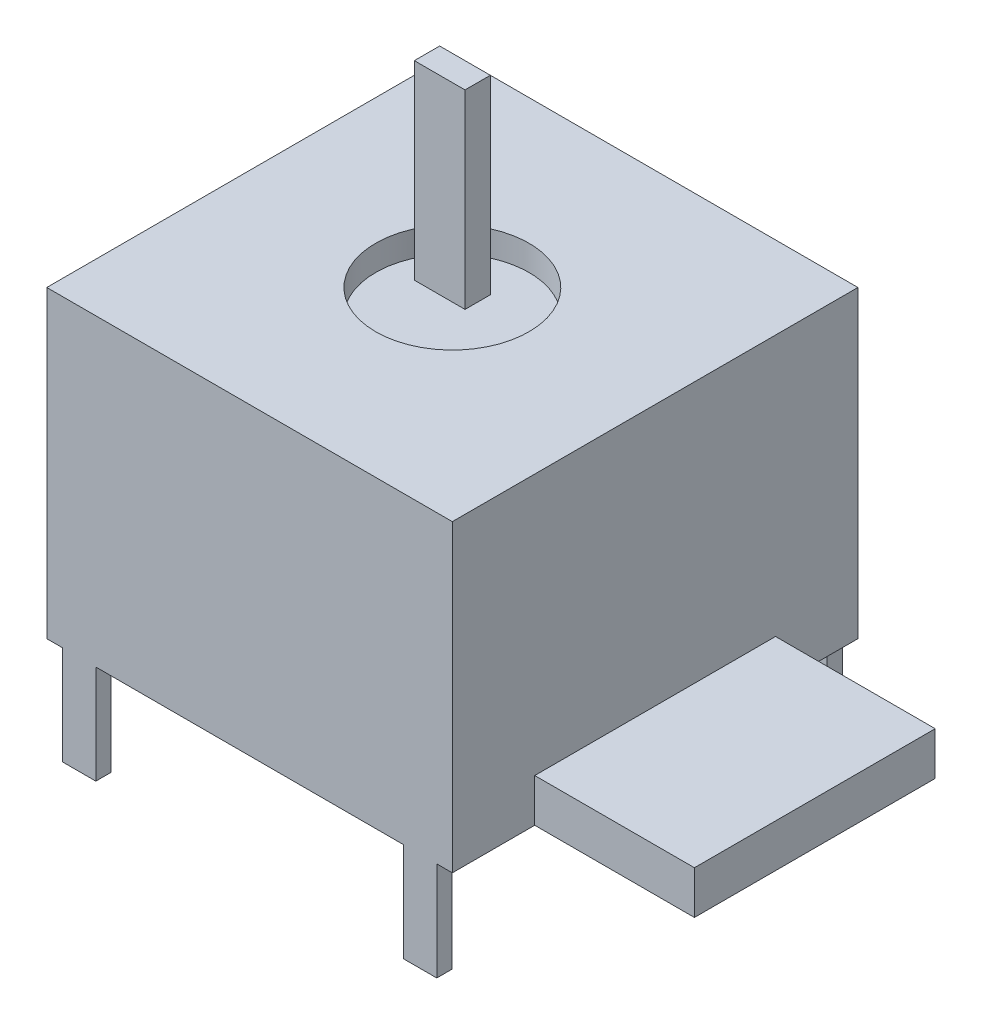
ISO-10303-21;
HEADER;
FILE_DESCRIPTION(('STEP AP214'),'2;1');
FILE_NAME('part.step','',(''),(''),'','','');
FILE_SCHEMA(('AUTOMOTIVE_DESIGN { 1 0 10303 214 1 1 1 1 }'));
ENDSEC;
DATA;
#1=APPLICATION_CONTEXT('core data for automotive mechanical design processes');
#2=APPLICATION_PROTOCOL_DEFINITION('international standard','automotive_design',2000,#1);
#3=PRODUCT_CONTEXT('',#1,'mechanical');
#4=PRODUCT('Part','Part','',(#3));
#5=PRODUCT_RELATED_PRODUCT_CATEGORY('part','',(#4));
#6=PRODUCT_DEFINITION_FORMATION('','',#4);
#7=PRODUCT_DEFINITION_CONTEXT('part definition',#1,'design');
#8=PRODUCT_DEFINITION('design','',#6,#7);
#9=PRODUCT_DEFINITION_SHAPE('','',#8);
#10=(LENGTH_UNIT() NAMED_UNIT(*) SI_UNIT(.MILLI.,.METRE.));
#11=(NAMED_UNIT(*) PLANE_ANGLE_UNIT() SI_UNIT($,.RADIAN.));
#12=(NAMED_UNIT(*) SI_UNIT($,.STERADIAN.) SOLID_ANGLE_UNIT());
#13=UNCERTAINTY_MEASURE_WITH_UNIT(LENGTH_MEASURE(1.E-05),#10,'distance_accuracy_value','');
#14=(GEOMETRIC_REPRESENTATION_CONTEXT(3) GLOBAL_UNCERTAINTY_ASSIGNED_CONTEXT((#13)) GLOBAL_UNIT_ASSIGNED_CONTEXT((#10,
#11,#12)) REPRESENTATION_CONTEXT('',''));
#15=CARTESIAN_POINT('',(0.,0.,0.));
#16=DIRECTION('',(0.,0.,1.));
#17=DIRECTION('',(1.,0.,0.));
#18=AXIS2_PLACEMENT_3D('',#15,#16,#17);
#19=CARTESIAN_POINT('',(0.,12.,-16.));
#20=DIRECTION('',(0.,-1.,0.));
#21=DIRECTION('',(0.,0.,-1.));
#22=AXIS2_PLACEMENT_3D('',#19,#20,#21);
#23=PLANE('',#22);
#24=CARTESIAN_POINT('',(8.,12.,-8.));
#25=DIRECTION('',(0.,1.,0.));
#26=DIRECTION('',(0.,0.,1.));
#27=AXIS2_PLACEMENT_3D('',#24,#25,#26);
#28=CIRCLE('',#27,3.02568881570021);
#29=CARTESIAN_POINT('',(8.,12.,-4.97431118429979));
#30=VERTEX_POINT('',#29);
#31=EDGE_CURVE('E40',#30,#30,#28,.T.);
#32=ORIENTED_EDGE('',*,*,#31,.F.);
#33=EDGE_LOOP('',(#32));
#34=FACE_BOUND('',#33,.T.);
#35=DIRECTION('',(0.,0.,1.));
#36=VECTOR('',#35,1.);
#37=CARTESIAN_POINT('',(0.,12.,0.));
#38=LINE('',#37,#36);
#39=CARTESIAN_POINT('',(0.,12.,-16.));
#40=VERTEX_POINT('',#39);
#41=CARTESIAN_POINT('',(0.,12.,0.));
#42=VERTEX_POINT('',#41);
#43=EDGE_CURVE('E282',#40,#42,#38,.T.);
#44=ORIENTED_EDGE('',*,*,#43,.T.);
#45=DIRECTION('',(1.,0.,0.));
#46=VECTOR('',#45,1.);
#47=CARTESIAN_POINT('',(0.,12.,0.));
#48=LINE('',#47,#46);
#49=CARTESIAN_POINT('',(16.,12.,0.));
#50=VERTEX_POINT('',#49);
#51=EDGE_CURVE('E280',#42,#50,#48,.T.);
#52=ORIENTED_EDGE('',*,*,#51,.T.);
#53=DIRECTION('',(0.,0.,-1.));
#54=VECTOR('',#53,1.);
#55=CARTESIAN_POINT('',(16.,12.,0.));
#56=LINE('',#55,#54);
#57=CARTESIAN_POINT('',(16.,12.,-16.));
#58=VERTEX_POINT('',#57);
#59=EDGE_CURVE('E277',#50,#58,#56,.T.);
#60=ORIENTED_EDGE('',*,*,#59,.T.);
#61=DIRECTION('',(-1.,0.,0.));
#62=VECTOR('',#61,1.);
#63=CARTESIAN_POINT('',(0.,12.,-16.));
#64=LINE('',#63,#62);
#65=EDGE_CURVE('E273',#58,#40,#64,.T.);
#66=ORIENTED_EDGE('',*,*,#65,.T.);
#67=EDGE_LOOP('',(#44,#52,#60,#66));
#68=FACE_BOUND('',#67,.T.);
#69=ADVANCED_FACE('F36',(#34,#68),#23,.F.);
#70=CARTESIAN_POINT('',(0.,0.,-16.));
#71=DIRECTION('',(0.,-1.,0.));
#72=DIRECTION('',(0.,0.,-1.));
#73=AXIS2_PLACEMENT_3D('',#70,#71,#72);
#74=PLANE('',#73);
#75=DIRECTION('',(-1.,0.,0.));
#76=VECTOR('',#75,1.);
#77=CARTESIAN_POINT('',(0.615000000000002,0.,-15.4));
#78=LINE('',#77,#76);
#79=CARTESIAN_POINT('',(1.935,0.,-15.4));
#80=VERTEX_POINT('',#79);
#81=CARTESIAN_POINT('',(0.615000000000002,0.,-15.4));
#82=VERTEX_POINT('',#81);
#83=EDGE_CURVE('E200',#80,#82,#78,.T.);
#84=ORIENTED_EDGE('',*,*,#83,.F.);
#85=DIRECTION('',(0.,0.,1.));
#86=VECTOR('',#85,1.);
#87=CARTESIAN_POINT('',(1.935,0.,-16.));
#88=LINE('',#87,#86);
#89=CARTESIAN_POINT('',(1.935,0.,-16.));
#90=VERTEX_POINT('',#89);
#91=EDGE_CURVE('E75',#90,#80,#88,.T.);
#92=ORIENTED_EDGE('',*,*,#91,.F.);
#93=DIRECTION('',(-1.,0.,0.));
#94=VECTOR('',#93,1.);
#95=CARTESIAN_POINT('',(0.,0.,-16.));
#96=LINE('',#95,#94);
#97=CARTESIAN_POINT('',(14.065,0.,-16.));
#98=VERTEX_POINT('',#97);
#99=EDGE_CURVE('E186',#98,#90,#96,.T.);
#100=ORIENTED_EDGE('',*,*,#99,.F.);
#101=DIRECTION('',(0.,0.,-1.));
#102=VECTOR('',#101,1.);
#103=CARTESIAN_POINT('',(14.065,0.,-16.));
#104=LINE('',#103,#102);
#105=CARTESIAN_POINT('',(14.065,0.,-15.4));
#106=VERTEX_POINT('',#105);
#107=EDGE_CURVE('E178',#106,#98,#104,.T.);
#108=ORIENTED_EDGE('',*,*,#107,.F.);
#109=DIRECTION('',(-1.,0.,0.));
#110=VECTOR('',#109,1.);
#111=CARTESIAN_POINT('',(14.065,0.,-15.4));
#112=LINE('',#111,#110);
#113=CARTESIAN_POINT('',(15.385,0.,-15.4));
#114=VERTEX_POINT('',#113);
#115=EDGE_CURVE('E175',#114,#106,#112,.T.);
#116=ORIENTED_EDGE('',*,*,#115,.F.);
#117=DIRECTION('',(0.,0.,1.));
#118=VECTOR('',#117,1.);
#119=CARTESIAN_POINT('',(15.385,0.,-16.));
#120=LINE('',#119,#118);
#121=CARTESIAN_POINT('',(15.385,0.,-16.));
#122=VERTEX_POINT('',#121);
#123=EDGE_CURVE('E106',#122,#114,#120,.T.);
#124=ORIENTED_EDGE('',*,*,#123,.F.);
#125=CARTESIAN_POINT('',(16.,0.,-16.));
#126=VERTEX_POINT('',#125);
#127=EDGE_CURVE('E187',#126,#122,#96,.T.);
#128=ORIENTED_EDGE('',*,*,#127,.F.);
#129=DIRECTION('',(0.,0.,-1.));
#130=VECTOR('',#129,1.);
#131=CARTESIAN_POINT('',(16.,0.,0.));
#132=LINE('',#131,#130);
#133=CARTESIAN_POINT('',(16.,0.,-12.75));
#134=VERTEX_POINT('',#133);
#135=EDGE_CURVE('E268',#134,#126,#132,.T.);
#136=ORIENTED_EDGE('',*,*,#135,.F.);
#137=DIRECTION('',(-1.,0.,0.));
#138=VECTOR('',#137,1.);
#139=CARTESIAN_POINT('',(22.3,0.,-12.75));
#140=LINE('',#139,#138);
#141=CARTESIAN_POINT('',(22.3,0.,-12.75));
#142=VERTEX_POINT('',#141);
#143=EDGE_CURVE('E326',#142,#134,#140,.T.);
#144=ORIENTED_EDGE('',*,*,#143,.F.);
#145=DIRECTION('',(0.,0.,-1.));
#146=VECTOR('',#145,1.);
#147=CARTESIAN_POINT('',(22.3,0.,-3.25000000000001));
#148=LINE('',#147,#146);
#149=CARTESIAN_POINT('',(22.3,0.,-3.25000000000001));
#150=VERTEX_POINT('',#149);
#151=EDGE_CURVE('E319',#150,#142,#148,.T.);
#152=ORIENTED_EDGE('',*,*,#151,.F.);
#153=DIRECTION('',(-1.,0.,0.));
#154=VECTOR('',#153,1.);
#155=CARTESIAN_POINT('',(22.3,0.,-3.25000000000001));
#156=LINE('',#155,#154);
#157=CARTESIAN_POINT('',(16.,0.,-3.25));
#158=VERTEX_POINT('',#157);
#159=EDGE_CURVE('E276',#150,#158,#156,.T.);
#160=ORIENTED_EDGE('',*,*,#159,.T.);
#161=CARTESIAN_POINT('',(16.,0.,0.));
#162=VERTEX_POINT('',#161);
#163=EDGE_CURVE('E264',#162,#158,#132,.T.);
#164=ORIENTED_EDGE('',*,*,#163,.F.);
#165=DIRECTION('',(1.,0.,0.));
#166=VECTOR('',#165,1.);
#167=CARTESIAN_POINT('',(0.,0.,0.));
#168=LINE('',#167,#166);
#169=CARTESIAN_POINT('',(15.385,0.,0.));
#170=VERTEX_POINT('',#169);
#171=EDGE_CURVE('E164',#170,#162,#168,.T.);
#172=ORIENTED_EDGE('',*,*,#171,.F.);
#173=DIRECTION('',(0.,0.,1.));
#174=VECTOR('',#173,1.);
#175=CARTESIAN_POINT('',(15.385,0.,0.));
#176=LINE('',#175,#174);
#177=CARTESIAN_POINT('',(15.385,0.,-0.6));
#178=VERTEX_POINT('',#177);
#179=EDGE_CURVE('E155',#178,#170,#176,.T.);
#180=ORIENTED_EDGE('',*,*,#179,.F.);
#181=DIRECTION('',(1.,0.,0.));
#182=VECTOR('',#181,1.);
#183=CARTESIAN_POINT('',(14.065,0.,-0.6));
#184=LINE('',#183,#182);
#185=CARTESIAN_POINT('',(14.065,0.,-0.6));
#186=VERTEX_POINT('',#185);
#187=EDGE_CURVE('E137',#186,#178,#184,.T.);
#188=ORIENTED_EDGE('',*,*,#187,.F.);
#189=DIRECTION('',(0.,0.,-1.));
#190=VECTOR('',#189,1.);
#191=CARTESIAN_POINT('',(14.065,0.,0.));
#192=LINE('',#191,#190);
#193=CARTESIAN_POINT('',(14.065,0.,0.));
#194=VERTEX_POINT('',#193);
#195=EDGE_CURVE('E170',#194,#186,#192,.T.);
#196=ORIENTED_EDGE('',*,*,#195,.F.);
#197=CARTESIAN_POINT('',(1.935,0.,0.));
#198=VERTEX_POINT('',#197);
#199=EDGE_CURVE('E610',#198,#194,#168,.T.);
#200=ORIENTED_EDGE('',*,*,#199,.F.);
#201=DIRECTION('',(0.,0.,1.));
#202=VECTOR('',#201,1.);
#203=CARTESIAN_POINT('',(1.935,0.,0.));
#204=LINE('',#203,#202);
#205=CARTESIAN_POINT('',(1.935,0.,-0.6));
#206=VERTEX_POINT('',#205);
#207=EDGE_CURVE('E621',#206,#198,#204,.T.);
#208=ORIENTED_EDGE('',*,*,#207,.F.);
#209=DIRECTION('',(1.,0.,0.));
#210=VECTOR('',#209,1.);
#211=CARTESIAN_POINT('',(0.615000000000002,0.,-0.6));
#212=LINE('',#211,#210);
#213=CARTESIAN_POINT('',(0.615000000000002,0.,-0.6));
#214=VERTEX_POINT('',#213);
#215=EDGE_CURVE('E600',#214,#206,#212,.T.);
#216=ORIENTED_EDGE('',*,*,#215,.F.);
#217=DIRECTION('',(0.,0.,-1.));
#218=VECTOR('',#217,1.);
#219=CARTESIAN_POINT('',(0.615000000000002,0.,0.));
#220=LINE('',#219,#218);
#221=CARTESIAN_POINT('',(0.615000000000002,0.,0.));
#222=VERTEX_POINT('',#221);
#223=EDGE_CURVE('E315',#222,#214,#220,.T.);
#224=ORIENTED_EDGE('',*,*,#223,.F.);
#225=CARTESIAN_POINT('',(0.,0.,0.));
#226=VERTEX_POINT('',#225);
#227=EDGE_CURVE('E272',#226,#222,#168,.T.);
#228=ORIENTED_EDGE('',*,*,#227,.F.);
#229=DIRECTION('',(0.,0.,1.));
#230=VECTOR('',#229,1.);
#231=CARTESIAN_POINT('',(0.,0.,0.));
#232=LINE('',#231,#230);
#233=CARTESIAN_POINT('',(0.,0.,-16.));
#234=VERTEX_POINT('',#233);
#235=EDGE_CURVE('E235',#234,#226,#232,.T.);
#236=ORIENTED_EDGE('',*,*,#235,.F.);
#237=CARTESIAN_POINT('',(0.615000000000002,0.,-16.));
#238=VERTEX_POINT('',#237);
#239=EDGE_CURVE('E211',#238,#234,#96,.T.);
#240=ORIENTED_EDGE('',*,*,#239,.F.);
#241=DIRECTION('',(0.,0.,-1.));
#242=VECTOR('',#241,1.);
#243=CARTESIAN_POINT('',(0.615000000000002,0.,-16.));
#244=LINE('',#243,#242);
#245=EDGE_CURVE('E203',#82,#238,#244,.T.);
#246=ORIENTED_EDGE('',*,*,#245,.F.);
#247=EDGE_LOOP('',(#84,#92,#100,#108,#116,#124,#128,#136,#144,#152,#160,#164,#172,#180,#188,
#196,#200,#208,#216,#224,#228,#236,#240,#246));
#248=FACE_BOUND('',#247,.T.);
#249=ADVANCED_FACE('F161',(#248),#74,.T.);
#250=CARTESIAN_POINT('',(16.,12.,0.));
#251=DIRECTION('',(-1.,0.,0.));
#252=DIRECTION('',(0.,0.,1.));
#253=AXIS2_PLACEMENT_3D('',#250,#251,#252);
#254=PLANE('',#253);
#255=DIRECTION('',(0.,-1.,0.));
#256=VECTOR('',#255,1.);
#257=CARTESIAN_POINT('',(16.,0.,-3.25));
#258=LINE('',#257,#256);
#259=CARTESIAN_POINT('',(16.,1.7,-3.25));
#260=VERTEX_POINT('',#259);
#261=EDGE_CURVE('E244',#260,#158,#258,.T.);
#262=ORIENTED_EDGE('',*,*,#261,.F.);
#263=DIRECTION('',(0.,0.,1.));
#264=VECTOR('',#263,1.);
#265=CARTESIAN_POINT('',(16.,1.7,-3.25));
#266=LINE('',#265,#264);
#267=CARTESIAN_POINT('',(16.,1.7,-12.75));
#268=VERTEX_POINT('',#267);
#269=EDGE_CURVE('E307',#268,#260,#266,.T.);
#270=ORIENTED_EDGE('',*,*,#269,.F.);
#271=DIRECTION('',(0.,1.,0.));
#272=VECTOR('',#271,1.);
#273=CARTESIAN_POINT('',(16.,0.,-12.75));
#274=LINE('',#273,#272);
#275=EDGE_CURVE('E311',#134,#268,#274,.T.);
#276=ORIENTED_EDGE('',*,*,#275,.F.);
#277=ORIENTED_EDGE('',*,*,#135,.T.);
#278=DIRECTION('',(0.,-1.,0.));
#279=VECTOR('',#278,1.);
#280=CARTESIAN_POINT('',(16.,12.,-16.));
#281=LINE('',#280,#279);
#282=EDGE_CURVE('E241',#58,#126,#281,.T.);
#283=ORIENTED_EDGE('',*,*,#282,.F.);
#284=ORIENTED_EDGE('',*,*,#59,.F.);
#285=DIRECTION('',(0.,-1.,0.));
#286=VECTOR('',#285,1.);
#287=CARTESIAN_POINT('',(16.,12.,0.));
#288=LINE('',#287,#286);
#289=EDGE_CURVE('E266',#50,#162,#288,.T.);
#290=ORIENTED_EDGE('',*,*,#289,.T.);
#291=ORIENTED_EDGE('',*,*,#163,.T.);
#292=EDGE_LOOP('',(#262,#270,#276,#277,#283,#284,#290,#291));
#293=FACE_BOUND('',#292,.T.);
#294=ADVANCED_FACE('F356',(#293),#254,.F.);
#295=CARTESIAN_POINT('',(0.,12.,0.));
#296=DIRECTION('',(1.,0.,0.));
#297=DIRECTION('',(0.,0.,-1.));
#298=AXIS2_PLACEMENT_3D('',#295,#296,#297);
#299=PLANE('',#298);
#300=ORIENTED_EDGE('',*,*,#235,.T.);
#301=DIRECTION('',(0.,-1.,0.));
#302=VECTOR('',#301,1.);
#303=CARTESIAN_POINT('',(0.,12.,0.));
#304=LINE('',#303,#302);
#305=EDGE_CURVE('E250',#42,#226,#304,.T.);
#306=ORIENTED_EDGE('',*,*,#305,.F.);
#307=ORIENTED_EDGE('',*,*,#43,.F.);
#308=DIRECTION('',(0.,-1.,0.));
#309=VECTOR('',#308,1.);
#310=CARTESIAN_POINT('',(0.,12.,-16.));
#311=LINE('',#310,#309);
#312=EDGE_CURVE('E270',#40,#234,#311,.T.);
#313=ORIENTED_EDGE('',*,*,#312,.T.);
#314=EDGE_LOOP('',(#300,#306,#307,#313));
#315=FACE_BOUND('',#314,.T.);
#316=ADVANCED_FACE('F294',(#315),#299,.F.);
#317=CARTESIAN_POINT('',(0.,12.,0.));
#318=DIRECTION('',(0.,0.,-1.));
#319=DIRECTION('',(-1.,0.,0.));
#320=AXIS2_PLACEMENT_3D('',#317,#318,#319);
#321=PLANE('',#320);
#322=ORIENTED_EDGE('',*,*,#227,.T.);
#323=DIRECTION('',(0.,1.,0.));
#324=VECTOR('',#323,1.);
#325=CARTESIAN_POINT('',(0.615000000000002,-3.9,0.));
#326=LINE('',#325,#324);
#327=CARTESIAN_POINT('',(0.615000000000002,-3.9,0.));
#328=VERTEX_POINT('',#327);
#329=EDGE_CURVE('E590',#328,#222,#326,.T.);
#330=ORIENTED_EDGE('',*,*,#329,.F.);
#331=DIRECTION('',(-1.,0.,0.));
#332=VECTOR('',#331,1.);
#333=CARTESIAN_POINT('',(0.615000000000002,-3.9,0.));
#334=LINE('',#333,#332);
#335=CARTESIAN_POINT('',(1.935,-3.9,0.));
#336=VERTEX_POINT('',#335);
#337=EDGE_CURVE('E172',#336,#328,#334,.T.);
#338=ORIENTED_EDGE('',*,*,#337,.F.);
#339=DIRECTION('',(0.,1.,0.));
#340=VECTOR('',#339,1.);
#341=CARTESIAN_POINT('',(1.935,-3.9,0.));
#342=LINE('',#341,#340);
#343=EDGE_CURVE('E595',#336,#198,#342,.T.);
#344=ORIENTED_EDGE('',*,*,#343,.T.);
#345=ORIENTED_EDGE('',*,*,#199,.T.);
#346=DIRECTION('',(0.,1.,0.));
#347=VECTOR('',#346,1.);
#348=CARTESIAN_POINT('',(14.065,-3.9,0.));
#349=LINE('',#348,#347);
#350=CARTESIAN_POINT('',(14.065,-3.9,0.));
#351=VERTEX_POINT('',#350);
#352=EDGE_CURVE('E148',#351,#194,#349,.T.);
#353=ORIENTED_EDGE('',*,*,#352,.F.);
#354=DIRECTION('',(-1.,0.,0.));
#355=VECTOR('',#354,1.);
#356=CARTESIAN_POINT('',(14.065,-3.9,0.));
#357=LINE('',#356,#355);
#358=CARTESIAN_POINT('',(15.385,-3.9,0.));
#359=VERTEX_POINT('',#358);
#360=EDGE_CURVE('E115',#359,#351,#357,.T.);
#361=ORIENTED_EDGE('',*,*,#360,.F.);
#362=DIRECTION('',(0.,1.,0.));
#363=VECTOR('',#362,1.);
#364=CARTESIAN_POINT('',(15.385,-3.9,0.));
#365=LINE('',#364,#363);
#366=EDGE_CURVE('E260',#359,#170,#365,.T.);
#367=ORIENTED_EDGE('',*,*,#366,.T.);
#368=ORIENTED_EDGE('',*,*,#171,.T.);
#369=ORIENTED_EDGE('',*,*,#289,.F.);
#370=ORIENTED_EDGE('',*,*,#51,.F.);
#371=ORIENTED_EDGE('',*,*,#305,.T.);
#372=EDGE_LOOP('',(#322,#330,#338,#344,#345,#353,#361,#367,#368,#369,#370,#371));
#373=FACE_BOUND('',#372,.T.);
#374=ADVANCED_FACE('F552',(#373),#321,.F.);
#375=CARTESIAN_POINT('',(0.,12.,-16.));
#376=DIRECTION('',(0.,0.,1.));
#377=DIRECTION('',(1.,0.,0.));
#378=AXIS2_PLACEMENT_3D('',#375,#376,#377);
#379=PLANE('',#378);
#380=ORIENTED_EDGE('',*,*,#127,.T.);
#381=DIRECTION('',(0.,1.,0.));
#382=VECTOR('',#381,1.);
#383=CARTESIAN_POINT('',(15.385,-3.9,-16.));
#384=LINE('',#383,#382);
#385=CARTESIAN_POINT('',(15.385,-3.9,-16.));
#386=VERTEX_POINT('',#385);
#387=EDGE_CURVE('E173',#386,#122,#384,.T.);
#388=ORIENTED_EDGE('',*,*,#387,.F.);
#389=DIRECTION('',(1.,0.,0.));
#390=VECTOR('',#389,1.);
#391=CARTESIAN_POINT('',(14.065,-3.9,-16.));
#392=LINE('',#391,#390);
#393=CARTESIAN_POINT('',(14.065,-3.9,-16.));
#394=VERTEX_POINT('',#393);
#395=EDGE_CURVE('E182',#394,#386,#392,.T.);
#396=ORIENTED_EDGE('',*,*,#395,.F.);
#397=DIRECTION('',(0.,1.,0.));
#398=VECTOR('',#397,1.);
#399=CARTESIAN_POINT('',(14.065,-3.9,-16.));
#400=LINE('',#399,#398);
#401=EDGE_CURVE('E183',#394,#98,#400,.T.);
#402=ORIENTED_EDGE('',*,*,#401,.T.);
#403=ORIENTED_EDGE('',*,*,#99,.T.);
#404=DIRECTION('',(0.,1.,0.));
#405=VECTOR('',#404,1.);
#406=CARTESIAN_POINT('',(1.935,-3.9,-16.));
#407=LINE('',#406,#405);
#408=CARTESIAN_POINT('',(1.935,-3.9,-16.));
#409=VERTEX_POINT('',#408);
#410=EDGE_CURVE('E198',#409,#90,#407,.T.);
#411=ORIENTED_EDGE('',*,*,#410,.F.);
#412=DIRECTION('',(1.,0.,0.));
#413=VECTOR('',#412,1.);
#414=CARTESIAN_POINT('',(0.615000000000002,-3.9,-16.));
#415=LINE('',#414,#413);
#416=CARTESIAN_POINT('',(0.615000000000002,-3.9,-16.));
#417=VERTEX_POINT('',#416);
#418=EDGE_CURVE('E207',#417,#409,#415,.T.);
#419=ORIENTED_EDGE('',*,*,#418,.F.);
#420=DIRECTION('',(0.,1.,0.));
#421=VECTOR('',#420,1.);
#422=CARTESIAN_POINT('',(0.615000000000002,-3.9,-16.));
#423=LINE('',#422,#421);
#424=EDGE_CURVE('E208',#417,#238,#423,.T.);
#425=ORIENTED_EDGE('',*,*,#424,.T.);
#426=ORIENTED_EDGE('',*,*,#239,.T.);
#427=ORIENTED_EDGE('',*,*,#312,.F.);
#428=ORIENTED_EDGE('',*,*,#65,.F.);
#429=ORIENTED_EDGE('',*,*,#282,.T.);
#430=EDGE_LOOP('',(#380,#388,#396,#402,#403,#411,#419,#425,#426,#427,#428,#429));
#431=FACE_BOUND('',#430,.T.);
#432=ADVANCED_FACE('F364',(#431),#379,.F.);
#433=CARTESIAN_POINT('',(22.3,0.,-3.25000000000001));
#434=DIRECTION('',(0.,0.,-1.));
#435=DIRECTION('',(0.,1.,0.));
#436=AXIS2_PLACEMENT_3D('',#433,#434,#435);
#437=PLANE('',#436);
#438=ORIENTED_EDGE('',*,*,#261,.T.);
#439=ORIENTED_EDGE('',*,*,#159,.F.);
#440=DIRECTION('',(0.,-1.,0.));
#441=VECTOR('',#440,1.);
#442=CARTESIAN_POINT('',(22.3,0.,-3.25000000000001));
#443=LINE('',#442,#441);
#444=CARTESIAN_POINT('',(22.3,1.7,-3.25));
#445=VERTEX_POINT('',#444);
#446=EDGE_CURVE('E306',#445,#150,#443,.T.);
#447=ORIENTED_EDGE('',*,*,#446,.F.);
#448=DIRECTION('',(-1.,0.,0.));
#449=VECTOR('',#448,1.);
#450=CARTESIAN_POINT('',(22.3,1.7,-3.25));
#451=LINE('',#450,#449);
#452=EDGE_CURVE('E308',#445,#260,#451,.T.);
#453=ORIENTED_EDGE('',*,*,#452,.T.);
#454=EDGE_LOOP('',(#438,#439,#447,#453));
#455=FACE_BOUND('',#454,.T.);
#456=ADVANCED_FACE('F402',(#455),#437,.F.);
#457=CARTESIAN_POINT('',(22.3,0.,-12.75));
#458=DIRECTION('',(0.,0.,1.));
#459=DIRECTION('',(0.,-1.,0.));
#460=AXIS2_PLACEMENT_3D('',#457,#458,#459);
#461=PLANE('',#460);
#462=ORIENTED_EDGE('',*,*,#275,.T.);
#463=DIRECTION('',(-1.,0.,0.));
#464=VECTOR('',#463,1.);
#465=CARTESIAN_POINT('',(22.3,1.7,-12.75));
#466=LINE('',#465,#464);
#467=CARTESIAN_POINT('',(22.3,1.7,-12.75));
#468=VERTEX_POINT('',#467);
#469=EDGE_CURVE('E303',#468,#268,#466,.T.);
#470=ORIENTED_EDGE('',*,*,#469,.F.);
#471=DIRECTION('',(0.,1.,0.));
#472=VECTOR('',#471,1.);
#473=CARTESIAN_POINT('',(22.3,0.,-12.75));
#474=LINE('',#473,#472);
#475=EDGE_CURVE('E316',#142,#468,#474,.T.);
#476=ORIENTED_EDGE('',*,*,#475,.F.);
#477=ORIENTED_EDGE('',*,*,#143,.T.);
#478=EDGE_LOOP('',(#462,#470,#476,#477));
#479=FACE_BOUND('',#478,.T.);
#480=ADVANCED_FACE('F405',(#479),#461,.F.);
#481=CARTESIAN_POINT('',(22.3,1.7,-3.25));
#482=DIRECTION('',(0.,-1.,0.));
#483=DIRECTION('',(0.,0.,-1.));
#484=AXIS2_PLACEMENT_3D('',#481,#482,#483);
#485=PLANE('',#484);
#486=ORIENTED_EDGE('',*,*,#269,.T.);
#487=ORIENTED_EDGE('',*,*,#452,.F.);
#488=DIRECTION('',(0.,0.,1.));
#489=VECTOR('',#488,1.);
#490=CARTESIAN_POINT('',(22.3,1.7,-3.25));
#491=LINE('',#490,#489);
#492=EDGE_CURVE('E312',#468,#445,#491,.T.);
#493=ORIENTED_EDGE('',*,*,#492,.F.);
#494=ORIENTED_EDGE('',*,*,#469,.T.);
#495=EDGE_LOOP('',(#486,#487,#493,#494));
#496=FACE_BOUND('',#495,.T.);
#497=ADVANCED_FACE('F409',(#496),#485,.F.);
#498=CARTESIAN_POINT('',(22.3,1.7,-3.25));
#499=DIRECTION('',(-1.,0.,0.));
#500=DIRECTION('',(0.,0.,1.));
#501=AXIS2_PLACEMENT_3D('',#498,#499,#500);
#502=PLANE('',#501);
#503=ORIENTED_EDGE('',*,*,#446,.T.);
#504=ORIENTED_EDGE('',*,*,#151,.T.);
#505=ORIENTED_EDGE('',*,*,#475,.T.);
#506=ORIENTED_EDGE('',*,*,#492,.T.);
#507=EDGE_LOOP('',(#503,#504,#505,#506));
#508=FACE_BOUND('',#507,.T.);
#509=ADVANCED_FACE('F413',(#508),#502,.F.);
#510=CARTESIAN_POINT('',(0.615000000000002,-3.9,0.));
#511=DIRECTION('',(1.,0.,0.));
#512=DIRECTION('',(0.,0.,-1.));
#513=AXIS2_PLACEMENT_3D('',#510,#511,#512);
#514=PLANE('',#513);
#515=ORIENTED_EDGE('',*,*,#223,.T.);
#516=DIRECTION('',(0.,1.,0.));
#517=VECTOR('',#516,1.);
#518=CARTESIAN_POINT('',(0.615000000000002,-3.9,-0.6));
#519=LINE('',#518,#517);
#520=CARTESIAN_POINT('',(0.615000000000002,-3.9,-0.6));
#521=VERTEX_POINT('',#520);
#522=EDGE_CURVE('E329',#521,#214,#519,.T.);
#523=ORIENTED_EDGE('',*,*,#522,.F.);
#524=DIRECTION('',(0.,0.,-1.));
#525=VECTOR('',#524,1.);
#526=CARTESIAN_POINT('',(0.615000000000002,-3.9,0.));
#527=LINE('',#526,#525);
#528=EDGE_CURVE('E599',#328,#521,#527,.T.);
#529=ORIENTED_EDGE('',*,*,#528,.F.);
#530=ORIENTED_EDGE('',*,*,#329,.T.);
#531=EDGE_LOOP('',(#515,#523,#529,#530));
#532=FACE_BOUND('',#531,.T.);
#533=ADVANCED_FACE('F417',(#532),#514,.F.);
#534=CARTESIAN_POINT('',(0.615000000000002,-3.9,-0.6));
#535=DIRECTION('',(0.,0.,1.));
#536=DIRECTION('',(1.,0.,0.));
#537=AXIS2_PLACEMENT_3D('',#534,#535,#536);
#538=PLANE('',#537);
#539=ORIENTED_EDGE('',*,*,#215,.T.);
#540=DIRECTION('',(0.,1.,0.));
#541=VECTOR('',#540,1.);
#542=CARTESIAN_POINT('',(1.935,-3.9,-0.6));
#543=LINE('',#542,#541);
#544=CARTESIAN_POINT('',(1.935,-3.9,-0.6));
#545=VERTEX_POINT('',#544);
#546=EDGE_CURVE('E624',#545,#206,#543,.T.);
#547=ORIENTED_EDGE('',*,*,#546,.F.);
#548=DIRECTION('',(1.,0.,0.));
#549=VECTOR('',#548,1.);
#550=CARTESIAN_POINT('',(0.615000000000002,-3.9,-0.6));
#551=LINE('',#550,#549);
#552=EDGE_CURVE('E645',#521,#545,#551,.T.);
#553=ORIENTED_EDGE('',*,*,#552,.F.);
#554=ORIENTED_EDGE('',*,*,#522,.T.);
#555=EDGE_LOOP('',(#539,#547,#553,#554));
#556=FACE_BOUND('',#555,.T.);
#557=ADVANCED_FACE('F421',(#556),#538,.F.);
#558=CARTESIAN_POINT('',(1.935,-3.9,0.));
#559=DIRECTION('',(-1.,0.,0.));
#560=DIRECTION('',(0.,0.,1.));
#561=AXIS2_PLACEMENT_3D('',#558,#559,#560);
#562=PLANE('',#561);
#563=ORIENTED_EDGE('',*,*,#207,.T.);
#564=ORIENTED_EDGE('',*,*,#343,.F.);
#565=DIRECTION('',(0.,0.,1.));
#566=VECTOR('',#565,1.);
#567=CARTESIAN_POINT('',(1.935,-3.9,0.));
#568=LINE('',#567,#566);
#569=EDGE_CURVE('E643',#545,#336,#568,.T.);
#570=ORIENTED_EDGE('',*,*,#569,.F.);
#571=ORIENTED_EDGE('',*,*,#546,.T.);
#572=EDGE_LOOP('',(#563,#564,#570,#571));
#573=FACE_BOUND('',#572,.T.);
#574=ADVANCED_FACE('F425',(#573),#562,.F.);
#575=CARTESIAN_POINT('',(0.615000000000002,-3.9,-0.6));
#576=DIRECTION('',(0.,-1.,0.));
#577=DIRECTION('',(0.,0.,-1.));
#578=AXIS2_PLACEMENT_3D('',#575,#576,#577);
#579=PLANE('',#578);
#580=ORIENTED_EDGE('',*,*,#528,.T.);
#581=ORIENTED_EDGE('',*,*,#552,.T.);
#582=ORIENTED_EDGE('',*,*,#569,.T.);
#583=ORIENTED_EDGE('',*,*,#337,.T.);
#584=EDGE_LOOP('',(#580,#581,#582,#583));
#585=FACE_BOUND('',#584,.T.);
#586=ADVANCED_FACE('F429',(#585),#579,.T.);
#587=CARTESIAN_POINT('',(14.065,-3.9,0.));
#588=DIRECTION('',(1.,0.,0.));
#589=DIRECTION('',(0.,0.,-1.));
#590=AXIS2_PLACEMENT_3D('',#587,#588,#589);
#591=PLANE('',#590);
#592=ORIENTED_EDGE('',*,*,#195,.T.);
#593=DIRECTION('',(0.,1.,0.));
#594=VECTOR('',#593,1.);
#595=CARTESIAN_POINT('',(14.065,-3.9,-0.6));
#596=LINE('',#595,#594);
#597=CARTESIAN_POINT('',(14.065,-3.9,-0.6));
#598=VERTEX_POINT('',#597);
#599=EDGE_CURVE('E143',#598,#186,#596,.T.);
#600=ORIENTED_EDGE('',*,*,#599,.F.);
#601=DIRECTION('',(0.,0.,-1.));
#602=VECTOR('',#601,1.);
#603=CARTESIAN_POINT('',(14.065,-3.9,0.));
#604=LINE('',#603,#602);
#605=EDGE_CURVE('E158',#351,#598,#604,.T.);
#606=ORIENTED_EDGE('',*,*,#605,.F.);
#607=ORIENTED_EDGE('',*,*,#352,.T.);
#608=EDGE_LOOP('',(#592,#600,#606,#607));
#609=FACE_BOUND('',#608,.T.);
#610=ADVANCED_FACE('F433',(#609),#591,.F.);
#611=CARTESIAN_POINT('',(14.065,-3.9,-0.6));
#612=DIRECTION('',(0.,0.,1.));
#613=DIRECTION('',(1.,0.,0.));
#614=AXIS2_PLACEMENT_3D('',#611,#612,#613);
#615=PLANE('',#614);
#616=ORIENTED_EDGE('',*,*,#187,.T.);
#617=DIRECTION('',(0.,1.,0.));
#618=VECTOR('',#617,1.);
#619=CARTESIAN_POINT('',(15.385,-3.9,-0.6));
#620=LINE('',#619,#618);
#621=CARTESIAN_POINT('',(15.385,-3.9,-0.6));
#622=VERTEX_POINT('',#621);
#623=EDGE_CURVE('E140',#622,#178,#620,.T.);
#624=ORIENTED_EDGE('',*,*,#623,.F.);
#625=DIRECTION('',(1.,0.,0.));
#626=VECTOR('',#625,1.);
#627=CARTESIAN_POINT('',(14.065,-3.9,-0.6));
#628=LINE('',#627,#626);
#629=EDGE_CURVE('E631',#598,#622,#628,.T.);
#630=ORIENTED_EDGE('',*,*,#629,.F.);
#631=ORIENTED_EDGE('',*,*,#599,.T.);
#632=EDGE_LOOP('',(#616,#624,#630,#631));
#633=FACE_BOUND('',#632,.T.);
#634=ADVANCED_FACE('F139',(#633),#615,.F.);
#635=CARTESIAN_POINT('',(15.385,-3.9,0.));
#636=DIRECTION('',(-1.,0.,0.));
#637=DIRECTION('',(0.,0.,1.));
#638=AXIS2_PLACEMENT_3D('',#635,#636,#637);
#639=PLANE('',#638);
#640=ORIENTED_EDGE('',*,*,#179,.T.);
#641=ORIENTED_EDGE('',*,*,#366,.F.);
#642=DIRECTION('',(0.,0.,1.));
#643=VECTOR('',#642,1.);
#644=CARTESIAN_POINT('',(15.385,-3.9,0.));
#645=LINE('',#644,#643);
#646=EDGE_CURVE('E157',#622,#359,#645,.T.);
#647=ORIENTED_EDGE('',*,*,#646,.F.);
#648=ORIENTED_EDGE('',*,*,#623,.T.);
#649=EDGE_LOOP('',(#640,#641,#647,#648));
#650=FACE_BOUND('',#649,.T.);
#651=ADVANCED_FACE('F152',(#650),#639,.F.);
#652=CARTESIAN_POINT('',(14.065,-3.9,0.));
#653=DIRECTION('',(0.,-1.,0.));
#654=DIRECTION('',(0.,0.,-1.));
#655=AXIS2_PLACEMENT_3D('',#652,#653,#654);
#656=PLANE('',#655);
#657=ORIENTED_EDGE('',*,*,#605,.T.);
#658=ORIENTED_EDGE('',*,*,#629,.T.);
#659=ORIENTED_EDGE('',*,*,#646,.T.);
#660=ORIENTED_EDGE('',*,*,#360,.T.);
#661=EDGE_LOOP('',(#657,#658,#659,#660));
#662=FACE_BOUND('',#661,.T.);
#663=ADVANCED_FACE('F442',(#662),#656,.T.);
#664=CARTESIAN_POINT('',(15.385,-3.9,-16.));
#665=DIRECTION('',(-1.,0.,0.));
#666=DIRECTION('',(0.,0.,1.));
#667=AXIS2_PLACEMENT_3D('',#664,#665,#666);
#668=PLANE('',#667);
#669=ORIENTED_EDGE('',*,*,#123,.T.);
#670=DIRECTION('',(0.,1.,0.));
#671=VECTOR('',#670,1.);
#672=CARTESIAN_POINT('',(15.385,-3.9,-15.4));
#673=LINE('',#672,#671);
#674=CARTESIAN_POINT('',(15.385,-3.9,-15.4));
#675=VERTEX_POINT('',#674);
#676=EDGE_CURVE('E176',#675,#114,#673,.T.);
#677=ORIENTED_EDGE('',*,*,#676,.F.);
#678=DIRECTION('',(0.,0.,1.));
#679=VECTOR('',#678,1.);
#680=CARTESIAN_POINT('',(15.385,-3.9,-16.));
#681=LINE('',#680,#679);
#682=EDGE_CURVE('E191',#386,#675,#681,.T.);
#683=ORIENTED_EDGE('',*,*,#682,.F.);
#684=ORIENTED_EDGE('',*,*,#387,.T.);
#685=EDGE_LOOP('',(#669,#677,#683,#684));
#686=FACE_BOUND('',#685,.T.);
#687=ADVANCED_FACE('F367',(#686),#668,.F.);
#688=CARTESIAN_POINT('',(14.065,-3.9,-15.4));
#689=DIRECTION('',(0.,0.,-1.));
#690=DIRECTION('',(-1.,0.,0.));
#691=AXIS2_PLACEMENT_3D('',#688,#689,#690);
#692=PLANE('',#691);
#693=ORIENTED_EDGE('',*,*,#115,.T.);
#694=DIRECTION('',(0.,1.,0.));
#695=VECTOR('',#694,1.);
#696=CARTESIAN_POINT('',(14.065,-3.9,-15.4));
#697=LINE('',#696,#695);
#698=CARTESIAN_POINT('',(14.065,-3.9,-15.4));
#699=VERTEX_POINT('',#698);
#700=EDGE_CURVE('E179',#699,#106,#697,.T.);
#701=ORIENTED_EDGE('',*,*,#700,.F.);
#702=DIRECTION('',(-1.,0.,0.));
#703=VECTOR('',#702,1.);
#704=CARTESIAN_POINT('',(14.065,-3.9,-15.4));
#705=LINE('',#704,#703);
#706=EDGE_CURVE('E189',#675,#699,#705,.T.);
#707=ORIENTED_EDGE('',*,*,#706,.F.);
#708=ORIENTED_EDGE('',*,*,#676,.T.);
#709=EDGE_LOOP('',(#693,#701,#707,#708));
#710=FACE_BOUND('',#709,.T.);
#711=ADVANCED_FACE('F373',(#710),#692,.F.);
#712=CARTESIAN_POINT('',(14.065,-3.9,-16.));
#713=DIRECTION('',(1.,0.,0.));
#714=DIRECTION('',(0.,0.,-1.));
#715=AXIS2_PLACEMENT_3D('',#712,#713,#714);
#716=PLANE('',#715);
#717=ORIENTED_EDGE('',*,*,#107,.T.);
#718=ORIENTED_EDGE('',*,*,#401,.F.);
#719=DIRECTION('',(0.,0.,-1.));
#720=VECTOR('',#719,1.);
#721=CARTESIAN_POINT('',(14.065,-3.9,-16.));
#722=LINE('',#721,#720);
#723=EDGE_CURVE('E84',#699,#394,#722,.T.);
#724=ORIENTED_EDGE('',*,*,#723,.F.);
#725=ORIENTED_EDGE('',*,*,#700,.T.);
#726=EDGE_LOOP('',(#717,#718,#724,#725));
#727=FACE_BOUND('',#726,.T.);
#728=ADVANCED_FACE('F375',(#727),#716,.F.);
#729=CARTESIAN_POINT('',(15.385,-3.9,-16.));
#730=DIRECTION('',(0.,-1.,0.));
#731=DIRECTION('',(0.,0.,-1.));
#732=AXIS2_PLACEMENT_3D('',#729,#730,#731);
#733=PLANE('',#732);
#734=ORIENTED_EDGE('',*,*,#395,.T.);
#735=ORIENTED_EDGE('',*,*,#682,.T.);
#736=ORIENTED_EDGE('',*,*,#706,.T.);
#737=ORIENTED_EDGE('',*,*,#723,.T.);
#738=EDGE_LOOP('',(#734,#735,#736,#737));
#739=FACE_BOUND('',#738,.T.);
#740=ADVANCED_FACE('F369',(#739),#733,.T.);
#741=CARTESIAN_POINT('',(1.935,-3.9,-16.));
#742=DIRECTION('',(-1.,0.,0.));
#743=DIRECTION('',(0.,0.,1.));
#744=AXIS2_PLACEMENT_3D('',#741,#742,#743);
#745=PLANE('',#744);
#746=ORIENTED_EDGE('',*,*,#91,.T.);
#747=DIRECTION('',(0.,1.,0.));
#748=VECTOR('',#747,1.);
#749=CARTESIAN_POINT('',(1.935,-3.9,-15.4));
#750=LINE('',#749,#748);
#751=CARTESIAN_POINT('',(1.935,-3.9,-15.4));
#752=VERTEX_POINT('',#751);
#753=EDGE_CURVE('E201',#752,#80,#750,.T.);
#754=ORIENTED_EDGE('',*,*,#753,.F.);
#755=DIRECTION('',(0.,0.,1.));
#756=VECTOR('',#755,1.);
#757=CARTESIAN_POINT('',(1.935,-3.9,-16.));
#758=LINE('',#757,#756);
#759=EDGE_CURVE('E215',#409,#752,#758,.T.);
#760=ORIENTED_EDGE('',*,*,#759,.F.);
#761=ORIENTED_EDGE('',*,*,#410,.T.);
#762=EDGE_LOOP('',(#746,#754,#760,#761));
#763=FACE_BOUND('',#762,.T.);
#764=ADVANCED_FACE('F380',(#763),#745,.F.);
#765=CARTESIAN_POINT('',(0.615000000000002,-3.9,-15.4));
#766=DIRECTION('',(0.,0.,-1.));
#767=DIRECTION('',(-1.,0.,0.));
#768=AXIS2_PLACEMENT_3D('',#765,#766,#767);
#769=PLANE('',#768);
#770=ORIENTED_EDGE('',*,*,#83,.T.);
#771=DIRECTION('',(0.,1.,0.));
#772=VECTOR('',#771,1.);
#773=CARTESIAN_POINT('',(0.615000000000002,-3.9,-15.4));
#774=LINE('',#773,#772);
#775=CARTESIAN_POINT('',(0.615000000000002,-3.9,-15.4));
#776=VERTEX_POINT('',#775);
#777=EDGE_CURVE('E204',#776,#82,#774,.T.);
#778=ORIENTED_EDGE('',*,*,#777,.F.);
#779=DIRECTION('',(-1.,0.,0.));
#780=VECTOR('',#779,1.);
#781=CARTESIAN_POINT('',(0.615000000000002,-3.9,-15.4));
#782=LINE('',#781,#780);
#783=EDGE_CURVE('E213',#752,#776,#782,.T.);
#784=ORIENTED_EDGE('',*,*,#783,.F.);
#785=ORIENTED_EDGE('',*,*,#753,.T.);
#786=EDGE_LOOP('',(#770,#778,#784,#785));
#787=FACE_BOUND('',#786,.T.);
#788=ADVANCED_FACE('F223',(#787),#769,.F.);
#789=CARTESIAN_POINT('',(0.615000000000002,-3.9,-16.));
#790=DIRECTION('',(1.,0.,0.));
#791=DIRECTION('',(0.,0.,-1.));
#792=AXIS2_PLACEMENT_3D('',#789,#790,#791);
#793=PLANE('',#792);
#794=ORIENTED_EDGE('',*,*,#245,.T.);
#795=ORIENTED_EDGE('',*,*,#424,.F.);
#796=DIRECTION('',(0.,0.,-1.));
#797=VECTOR('',#796,1.);
#798=CARTESIAN_POINT('',(0.615000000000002,-3.9,-16.));
#799=LINE('',#798,#797);
#800=EDGE_CURVE('E53',#776,#417,#799,.T.);
#801=ORIENTED_EDGE('',*,*,#800,.F.);
#802=ORIENTED_EDGE('',*,*,#777,.T.);
#803=EDGE_LOOP('',(#794,#795,#801,#802));
#804=FACE_BOUND('',#803,.T.);
#805=ADVANCED_FACE('F227',(#804),#793,.F.);
#806=CARTESIAN_POINT('',(1.935,-3.9,-16.));
#807=DIRECTION('',(0.,-1.,0.));
#808=DIRECTION('',(0.,0.,-1.));
#809=AXIS2_PLACEMENT_3D('',#806,#807,#808);
#810=PLANE('',#809);
#811=ORIENTED_EDGE('',*,*,#418,.T.);
#812=ORIENTED_EDGE('',*,*,#759,.T.);
#813=ORIENTED_EDGE('',*,*,#783,.T.);
#814=ORIENTED_EDGE('',*,*,#800,.T.);
#815=EDGE_LOOP('',(#811,#812,#813,#814));
#816=FACE_BOUND('',#815,.T.);
#817=ADVANCED_FACE('F381',(#816),#810,.T.);
#818=CARTESIAN_POINT('',(8.,11.,-8.));
#819=DIRECTION('',(0.,1.,0.));
#820=DIRECTION('',(0.,0.,1.));
#821=AXIS2_PLACEMENT_3D('',#818,#819,#820);
#822=CYLINDRICAL_SURFACE('',#821,3.02568881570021);
#823=CARTESIAN_POINT('',(8.,11.,-8.));
#824=DIRECTION('',(0.,1.,0.));
#825=DIRECTION('',(0.,0.,1.));
#826=AXIS2_PLACEMENT_3D('',#823,#824,#825);
#827=CIRCLE('',#826,3.02568881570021);
#828=CARTESIAN_POINT('',(8.,11.,-4.97431118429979));
#829=VERTEX_POINT('',#828);
#830=EDGE_CURVE('E12',#829,#829,#827,.T.);
#831=ORIENTED_EDGE('',*,*,#830,.F.);
#832=EDGE_LOOP('',(#831));
#833=FACE_BOUND('',#832,.T.);
#834=ORIENTED_EDGE('',*,*,#31,.T.);
#835=EDGE_LOOP('',(#834));
#836=FACE_BOUND('',#835,.T.);
#837=ADVANCED_FACE('F383',(#833,#836),#822,.F.);
#838=CARTESIAN_POINT('',(8.,11.,-8.));
#839=DIRECTION('',(0.,1.,0.));
#840=DIRECTION('',(0.,0.,1.));
#841=AXIS2_PLACEMENT_3D('',#838,#839,#840);
#842=PLANE('',#841);
#843=ORIENTED_EDGE('',*,*,#830,.T.);
#844=EDGE_LOOP('',(#843));
#845=FACE_BOUND('',#844,.T.);
#846=ADVANCED_FACE('F38',(#845),#842,.T.);
#847=CLOSED_SHELL('',(#69,#249,#294,#316,#374,#432,#456,#480,#497,#509,#533,#557,#574,#586,#610,
#634,#651,#663,#687,#711,#728,#740,#764,#788,#805,#817,#837,#846));
#848=MANIFOLD_SOLID_BREP('B2',#847);
#849=CARTESIAN_POINT('',(9.,19.5,-7.5));
#850=DIRECTION('',(0.,-1.,0.));
#851=DIRECTION('',(0.,0.,-1.));
#852=AXIS2_PLACEMENT_3D('',#849,#850,#851);
#853=PLANE('',#852);
#854=DIRECTION('',(0.,0.,-1.));
#855=VECTOR('',#854,1.);
#856=CARTESIAN_POINT('',(9.,19.5,-8.5));
#857=LINE('',#856,#855);
#858=CARTESIAN_POINT('',(9.,19.5,-7.5));
#859=VERTEX_POINT('',#858);
#860=CARTESIAN_POINT('',(9.,19.5,-8.5));
#861=VERTEX_POINT('',#860);
#862=EDGE_CURVE('E740',#859,#861,#857,.T.);
#863=ORIENTED_EDGE('',*,*,#862,.T.);
#864=DIRECTION('',(-1.,0.,0.));
#865=VECTOR('',#864,1.);
#866=CARTESIAN_POINT('',(9.,19.5,-8.5));
#867=LINE('',#866,#865);
#868=CARTESIAN_POINT('',(7.,19.5,-8.5));
#869=VERTEX_POINT('',#868);
#870=EDGE_CURVE('E756',#861,#869,#867,.T.);
#871=ORIENTED_EDGE('',*,*,#870,.T.);
#872=DIRECTION('',(0.,0.,1.));
#873=VECTOR('',#872,1.);
#874=CARTESIAN_POINT('',(7.,19.5,-8.5));
#875=LINE('',#874,#873);
#876=CARTESIAN_POINT('',(7.,19.5,-7.5));
#877=VERTEX_POINT('',#876);
#878=EDGE_CURVE('E710',#869,#877,#875,.T.);
#879=ORIENTED_EDGE('',*,*,#878,.T.);
#880=DIRECTION('',(1.,0.,0.));
#881=VECTOR('',#880,1.);
#882=CARTESIAN_POINT('',(9.,19.5,-7.5));
#883=LINE('',#882,#881);
#884=EDGE_CURVE('E705',#877,#859,#883,.T.);
#885=ORIENTED_EDGE('',*,*,#884,.T.);
#886=EDGE_LOOP('',(#863,#871,#879,#885));
#887=FACE_BOUND('',#886,.T.);
#888=ADVANCED_FACE('F690',(#887),#853,.F.);
#889=CARTESIAN_POINT('',(9.,19.5,-7.5));
#890=DIRECTION('',(0.,0.,-1.));
#891=DIRECTION('',(-1.,0.,0.));
#892=AXIS2_PLACEMENT_3D('',#889,#890,#891);
#893=PLANE('',#892);
#894=DIRECTION('',(1.,0.,0.));
#895=VECTOR('',#894,1.);
#896=CARTESIAN_POINT('',(9.,12.,-7.5));
#897=LINE('',#896,#895);
#898=CARTESIAN_POINT('',(7.,12.,-7.5));
#899=VERTEX_POINT('',#898);
#900=CARTESIAN_POINT('',(9.,12.,-7.5));
#901=VERTEX_POINT('',#900);
#902=EDGE_CURVE('E730',#899,#901,#897,.T.);
#903=ORIENTED_EDGE('',*,*,#902,.T.);
#904=DIRECTION('',(0.,-1.,0.));
#905=VECTOR('',#904,1.);
#906=CARTESIAN_POINT('',(9.,19.5,-7.5));
#907=LINE('',#906,#905);
#908=EDGE_CURVE('E750',#859,#901,#907,.T.);
#909=ORIENTED_EDGE('',*,*,#908,.F.);
#910=ORIENTED_EDGE('',*,*,#884,.F.);
#911=DIRECTION('',(0.,-1.,0.));
#912=VECTOR('',#911,1.);
#913=CARTESIAN_POINT('',(7.,19.5,-7.5));
#914=LINE('',#913,#912);
#915=EDGE_CURVE('E745',#877,#899,#914,.T.);
#916=ORIENTED_EDGE('',*,*,#915,.T.);
#917=EDGE_LOOP('',(#903,#909,#910,#916));
#918=FACE_BOUND('',#917,.T.);
#919=ADVANCED_FACE('F749',(#918),#893,.F.);
#920=CARTESIAN_POINT('',(7.,19.5,-8.5));
#921=DIRECTION('',(1.,0.,0.));
#922=DIRECTION('',(0.,0.,-1.));
#923=AXIS2_PLACEMENT_3D('',#920,#921,#922);
#924=PLANE('',#923);
#925=DIRECTION('',(0.,0.,1.));
#926=VECTOR('',#925,1.);
#927=CARTESIAN_POINT('',(7.,12.,-8.5));
#928=LINE('',#927,#926);
#929=CARTESIAN_POINT('',(7.,12.,-8.5));
#930=VERTEX_POINT('',#929);
#931=EDGE_CURVE('E733',#930,#899,#928,.T.);
#932=ORIENTED_EDGE('',*,*,#931,.T.);
#933=ORIENTED_EDGE('',*,*,#915,.F.);
#934=ORIENTED_EDGE('',*,*,#878,.F.);
#935=DIRECTION('',(0.,-1.,0.));
#936=VECTOR('',#935,1.);
#937=CARTESIAN_POINT('',(7.,19.5,-8.5));
#938=LINE('',#937,#936);
#939=EDGE_CURVE('E698',#869,#930,#938,.T.);
#940=ORIENTED_EDGE('',*,*,#939,.T.);
#941=EDGE_LOOP('',(#932,#933,#934,#940));
#942=FACE_BOUND('',#941,.T.);
#943=ADVANCED_FACE('F744',(#942),#924,.F.);
#944=CARTESIAN_POINT('',(9.,19.5,-8.5));
#945=DIRECTION('',(0.,0.,1.));
#946=DIRECTION('',(1.,0.,0.));
#947=AXIS2_PLACEMENT_3D('',#944,#945,#946);
#948=PLANE('',#947);
#949=DIRECTION('',(-1.,0.,0.));
#950=VECTOR('',#949,1.);
#951=CARTESIAN_POINT('',(9.,12.,-8.5));
#952=LINE('',#951,#950);
#953=CARTESIAN_POINT('',(9.,12.,-8.5));
#954=VERTEX_POINT('',#953);
#955=EDGE_CURVE('E747',#954,#930,#952,.T.);
#956=ORIENTED_EDGE('',*,*,#955,.T.);
#957=ORIENTED_EDGE('',*,*,#939,.F.);
#958=ORIENTED_EDGE('',*,*,#870,.F.);
#959=DIRECTION('',(0.,-1.,0.));
#960=VECTOR('',#959,1.);
#961=CARTESIAN_POINT('',(9.,19.5,-8.5));
#962=LINE('',#961,#960);
#963=EDGE_CURVE('E34',#861,#954,#962,.T.);
#964=ORIENTED_EDGE('',*,*,#963,.T.);
#965=EDGE_LOOP('',(#956,#957,#958,#964));
#966=FACE_BOUND('',#965,.T.);
#967=ADVANCED_FACE('F764',(#966),#948,.F.);
#968=CARTESIAN_POINT('',(9.,19.5,-8.5));
#969=DIRECTION('',(-1.,0.,0.));
#970=DIRECTION('',(0.,0.,1.));
#971=AXIS2_PLACEMENT_3D('',#968,#969,#970);
#972=PLANE('',#971);
#973=DIRECTION('',(0.,0.,-1.));
#974=VECTOR('',#973,1.);
#975=CARTESIAN_POINT('',(9.,12.,-8.5));
#976=LINE('',#975,#974);
#977=EDGE_CURVE('E736',#901,#954,#976,.T.);
#978=ORIENTED_EDGE('',*,*,#977,.T.);
#979=ORIENTED_EDGE('',*,*,#963,.F.);
#980=ORIENTED_EDGE('',*,*,#862,.F.);
#981=ORIENTED_EDGE('',*,*,#908,.T.);
#982=EDGE_LOOP('',(#978,#979,#980,#981));
#983=FACE_BOUND('',#982,.T.);
#984=ADVANCED_FACE('F692',(#983),#972,.F.);
#985=CARTESIAN_POINT('',(8.,12.,-8.));
#986=DIRECTION('',(0.,1.,0.));
#987=DIRECTION('',(0.,0.,1.));
#988=AXIS2_PLACEMENT_3D('',#985,#986,#987);
#989=PLANE('',#988);
#990=ORIENTED_EDGE('',*,*,#902,.F.);
#991=ORIENTED_EDGE('',*,*,#931,.F.);
#992=ORIENTED_EDGE('',*,*,#955,.F.);
#993=ORIENTED_EDGE('',*,*,#977,.F.);
#994=EDGE_LOOP('',(#990,#991,#992,#993));
#995=FACE_BOUND('',#994,.T.);
#996=ADVANCED_FACE('F732',(#995),#989,.F.);
#997=CLOSED_SHELL('',(#888,#919,#943,#967,#984,#996));
#998=MANIFOLD_SOLID_BREP('B6',#997);
#999=ADVANCED_BREP_SHAPE_REPRESENTATION('',(#18,#848,#998),#14);
#1000=SHAPE_DEFINITION_REPRESENTATION(#9,#999);
ENDSEC;
END-ISO-10303-21;
